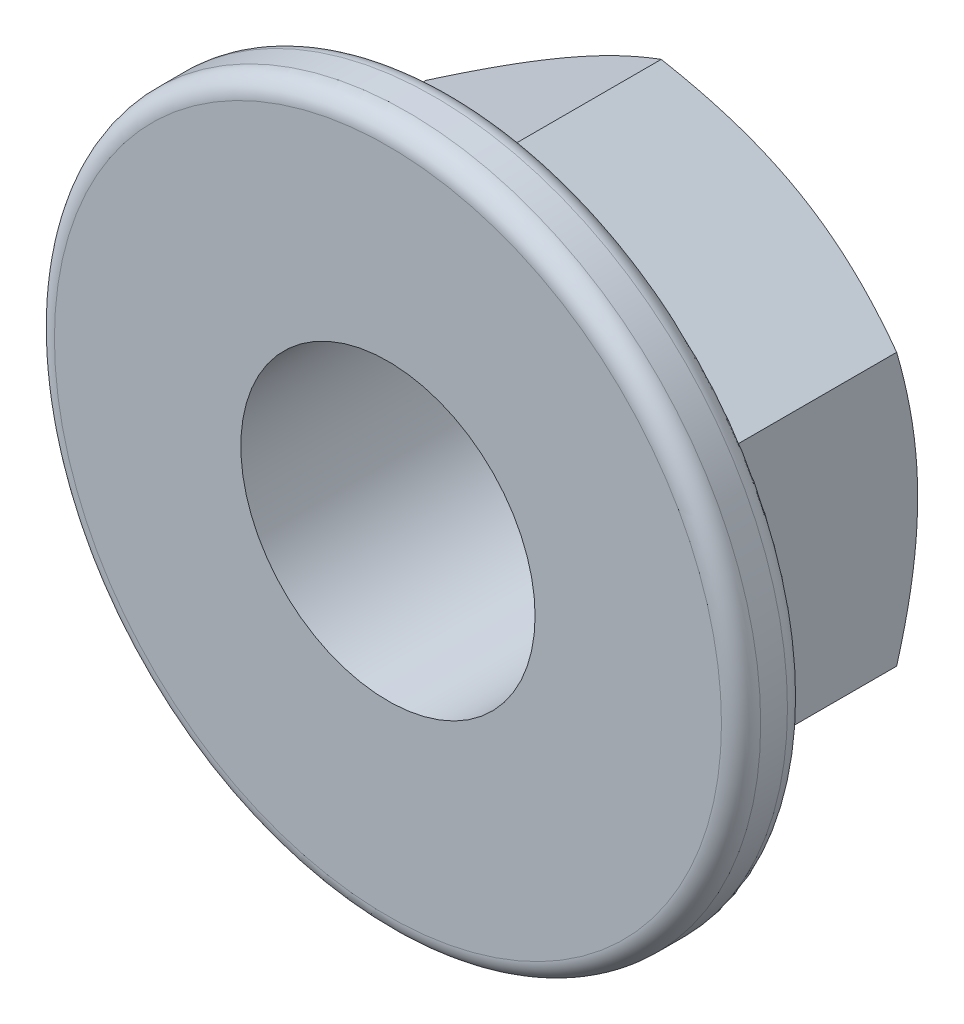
ISO-10303-21;
HEADER;
FILE_DESCRIPTION(('STEP AP214'),'2;1');
FILE_NAME('part.step','',(''),(''),'','','');
FILE_SCHEMA(('AUTOMOTIVE_DESIGN { 1 0 10303 214 1 1 1 1 }'));
ENDSEC;
DATA;
#1=APPLICATION_CONTEXT('core data for automotive mechanical design processes');
#2=APPLICATION_PROTOCOL_DEFINITION('international standard','automotive_design',2000,#1);
#3=PRODUCT_CONTEXT('',#1,'mechanical');
#4=PRODUCT('Part','Part','',(#3));
#5=PRODUCT_RELATED_PRODUCT_CATEGORY('part','',(#4));
#6=PRODUCT_DEFINITION_FORMATION('','',#4);
#7=PRODUCT_DEFINITION_CONTEXT('part definition',#1,'design');
#8=PRODUCT_DEFINITION('design','',#6,#7);
#9=PRODUCT_DEFINITION_SHAPE('','',#8);
#10=(LENGTH_UNIT() NAMED_UNIT(*) SI_UNIT(.MILLI.,.METRE.));
#11=(NAMED_UNIT(*) PLANE_ANGLE_UNIT() SI_UNIT($,.RADIAN.));
#12=(NAMED_UNIT(*) SI_UNIT($,.STERADIAN.) SOLID_ANGLE_UNIT());
#13=UNCERTAINTY_MEASURE_WITH_UNIT(LENGTH_MEASURE(1.E-05),#10,'distance_accuracy_value','');
#14=(GEOMETRIC_REPRESENTATION_CONTEXT(3) GLOBAL_UNCERTAINTY_ASSIGNED_CONTEXT((#13)) GLOBAL_UNIT_ASSIGNED_CONTEXT((#10,
#11,#12)) REPRESENTATION_CONTEXT('',''));
#15=CARTESIAN_POINT('',(0.,0.,0.));
#16=DIRECTION('',(0.,0.,1.));
#17=DIRECTION('',(1.,0.,0.));
#18=AXIS2_PLACEMENT_3D('',#15,#16,#17);
#19=CARTESIAN_POINT('',(4.,2.30940107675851,-5.));
#20=DIRECTION('',(0.499999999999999,0.866025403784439,0.));
#21=DIRECTION('',(-0.866025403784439,0.499999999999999,0.));
#22=AXIS2_PLACEMENT_3D('',#19,#20,#21);
#23=PLANE('',#22);
#24=DIRECTION('',(0.,0.,1.));
#25=VECTOR('',#24,1.);
#26=CARTESIAN_POINT('',(0.,4.61880215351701,-5.));
#27=LINE('',#26,#25);
#28=CARTESIAN_POINT('',(0.,4.61880215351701,-4.64273441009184));
#29=VERTEX_POINT('',#28);
#30=CARTESIAN_POINT('',(0.,4.61880215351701,-1.6440631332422));
#31=VERTEX_POINT('',#30);
#32=EDGE_CURVE('E467',#29,#31,#27,.T.);
#33=ORIENTED_EDGE('',*,*,#32,.T.);
#34=CARTESIAN_POINT('',(-0.000199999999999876,4.61891762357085,-1.64400928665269));
#35=CARTESIAN_POINT('',(0.120769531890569,4.54907583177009,-1.67657795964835));
#36=CARTESIAN_POINT('',(0.242185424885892,4.47897633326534,-1.70705523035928));
#37=CARTESIAN_POINT('',(0.48592837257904,4.33825127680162,-1.76310098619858));
#38=CARTESIAN_POINT('',(0.60825588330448,4.26762545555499,-1.78866681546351));
#39=CARTESIAN_POINT('',(0.853824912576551,4.12584611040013,-1.8341482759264));
#40=CARTESIAN_POINT('',(0.977067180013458,4.05469215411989,-1.8540585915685));
#41=CARTESIAN_POINT('',(1.22418358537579,3.91201943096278,-1.8874940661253));
#42=CARTESIAN_POINT('',(1.34805760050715,3.84050073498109,-1.90102042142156));
#43=CARTESIAN_POINT('',(1.59365872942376,3.69870285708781,-1.92094074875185));
#44=CARTESIAN_POINT('',(1.71537709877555,3.62842872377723,-1.92747679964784));
#45=CARTESIAN_POINT('',(1.95895426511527,3.48779938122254,-1.9336347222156));
#46=CARTESIAN_POINT('',(2.08081307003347,3.4174441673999,-1.93325618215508));
#47=CARTESIAN_POINT('',(2.32425174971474,3.27689478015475,-1.92560400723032));
#48=CARTESIAN_POINT('',(2.44583177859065,3.20670051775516,-1.91833679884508));
#49=CARTESIAN_POINT('',(2.68854759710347,3.0665684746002,-1.8972201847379));
#50=CARTESIAN_POINT('',(2.80968342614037,2.99663067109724,-1.88337137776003));
#51=CARTESIAN_POINT('',(3.02010677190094,2.87514269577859,-1.85398107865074));
#52=CARTESIAN_POINT('',(3.10954010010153,2.82350833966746,-1.8398003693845));
#53=CARTESIAN_POINT('',(3.28799787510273,2.72047569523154,-1.80837614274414));
#54=CARTESIAN_POINT('',(3.37702233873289,2.6690773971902,-1.79113275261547));
#55=CARTESIAN_POINT('',(3.55535029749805,2.5661197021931,-1.75371474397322));
#56=CARTESIAN_POINT('',(3.64465020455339,2.51456237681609,-1.73351749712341));
#57=CARTESIAN_POINT('',(3.82277777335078,2.41172037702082,-1.69059061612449));
#58=CARTESIAN_POINT('',(3.91160551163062,2.36043565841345,-1.66786140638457));
#59=CARTESIAN_POINT('',(4.0002,2.30928560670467,-1.64400928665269));
#60=B_SPLINE_CURVE_WITH_KNOTS('',3,(#34,#35,#36,#37,#38,#39,#40,#41,#42,#43,#44,#45,#46,#47,#48,
#49,#50,#51,#52,#53,#54,#55,#56,#57,#58,#59),.UNSPECIFIED.,.F.,.F.,(4,2,2,2,2,2,2,2,2,2,2,2,4),
(0.,0.430315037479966,0.860862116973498,1.29181253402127,1.72268215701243,2.14461740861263,
2.56657778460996,2.98814489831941,3.40967366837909,3.72234131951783,4.03499598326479,
4.35018512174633,4.66532150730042),.UNSPECIFIED.);
#61=CARTESIAN_POINT('',(4.,2.30940107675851,-1.6440631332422));
#62=VERTEX_POINT('',#61);
#63=EDGE_CURVE('E387',#31,#62,#60,.T.);
#64=ORIENTED_EDGE('',*,*,#63,.T.);
#65=DIRECTION('',(0.,0.,1.));
#66=VECTOR('',#65,1.);
#67=CARTESIAN_POINT('',(4.,2.30940107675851,-5.));
#68=LINE('',#67,#66);
#69=CARTESIAN_POINT('',(4.,2.30940107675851,-4.64273441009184));
#70=VERTEX_POINT('',#69);
#71=EDGE_CURVE('E482',#70,#62,#68,.T.);
#72=ORIENTED_EDGE('',*,*,#71,.F.);
#73=CARTESIAN_POINT('',(-0.0002,4.61891762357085,-4.64266774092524));
#74=CARTESIAN_POINT('',(0.175579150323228,4.51743148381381,-4.70128212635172));
#75=CARTESIAN_POINT('',(0.352875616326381,4.41506932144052,-4.75458967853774));
#76=CARTESIAN_POINT('',(0.710538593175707,4.2085725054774,-4.8476383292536));
#77=CARTESIAN_POINT('',(0.890911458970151,4.10443418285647,-4.8873465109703));
#78=CARTESIAN_POINT('',(1.24942181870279,3.89744813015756,-4.94915778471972));
#79=CARTESIAN_POINT('',(1.42750415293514,3.7946322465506,-4.97167226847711));
#80=CARTESIAN_POINT('',(1.78450671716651,3.58851671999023,-4.99854937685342));
#81=CARTESIAN_POINT('',(1.9634256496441,3.48521782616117,-5.00293425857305));
#82=CARTESIAN_POINT('',(2.29774284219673,3.29219970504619,-4.99380992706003));
#83=CARTESIAN_POINT('',(2.45319115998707,3.20245157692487,-4.98254104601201));
#84=CARTESIAN_POINT('',(2.76307505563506,3.02354002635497,-4.94682600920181));
#85=CARTESIAN_POINT('',(2.91750956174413,2.93437722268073,-4.92236765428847));
#86=CARTESIAN_POINT('',(3.22803232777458,2.75509682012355,-4.86122393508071));
#87=CARTESIAN_POINT('',(3.3840812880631,2.66500191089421,-4.82427939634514));
#88=CARTESIAN_POINT('',(3.69385183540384,2.48615580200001,-4.74042992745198));
#89=CARTESIAN_POINT('',(3.84757739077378,2.39740231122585,-4.69354469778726));
#90=CARTESIAN_POINT('',(4.0002,2.30928560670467,-4.64266774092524));
#91=B_SPLINE_CURVE_WITH_KNOTS('',3,(#73,#74,#75,#76,#77,#78,#79,#80,#81,#82,#83,#84,#85,#86,#87,
#88,#89,#90),.UNSPECIFIED.,.F.,.F.,(4,2,2,2,2,2,2,2,4),(0.,0.634047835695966,1.26961969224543,
1.88946157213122,2.50854226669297,3.04757825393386,3.58711366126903,4.13861653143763,
4.68903648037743),.UNSPECIFIED.);
#92=CARTESIAN_POINT('',(2.,3.46410161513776,-5.));
#93=VERTEX_POINT('',#92);
#94=EDGE_CURVE('E495',#93,#70,#91,.T.);
#95=ORIENTED_EDGE('',*,*,#94,.F.);
#96=EDGE_CURVE('E471',#29,#93,#91,.T.);
#97=ORIENTED_EDGE('',*,*,#96,.F.);
#98=EDGE_LOOP('',(#33,#64,#72,#95,#97));
#99=FACE_BOUND('',#98,.T.);
#100=ADVANCED_FACE('F368',(#99),#23,.T.);
#101=CARTESIAN_POINT('',(4.,-2.30940107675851,-5.));
#102=DIRECTION('',(1.,0.,0.));
#103=DIRECTION('',(0.,0.,-1.));
#104=AXIS2_PLACEMENT_3D('',#101,#102,#103);
#105=PLANE('',#104);
#106=ORIENTED_EDGE('',*,*,#71,.T.);
#107=CARTESIAN_POINT('',(4.,-6.18739775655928,-0.362202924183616));
#108=CARTESIAN_POINT('',(4.,-6.00693642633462,-0.432851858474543));
#109=CARTESIAN_POINT('',(4.,-5.82617418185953,-0.502746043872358));
#110=CARTESIAN_POINT('',(4.,-5.46388811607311,-0.640597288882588));
#111=CARTESIAN_POINT('',(4.,-5.28236420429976,-0.708554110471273));
#112=CARTESIAN_POINT('',(4.,-4.91784788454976,-0.842302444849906));
#113=CARTESIAN_POINT('',(4.,-4.73485262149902,-0.908086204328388));
#114=CARTESIAN_POINT('',(4.,-4.36781211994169,-1.03664742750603));
#115=CARTESIAN_POINT('',(4.,-4.18376691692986,-1.09942499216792));
#116=CARTESIAN_POINT('',(4.,-3.81684147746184,-1.22039744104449));
#117=CARTESIAN_POINT('',(4.,-3.63397756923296,-1.27864158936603));
#118=CARTESIAN_POINT('',(4.,-3.26681247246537,-1.39047286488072));
#119=CARTESIAN_POINT('',(4.,-3.08251121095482,-1.44405975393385));
#120=CARTESIAN_POINT('',(4.,-2.71244508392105,-1.54528850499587));
#121=CARTESIAN_POINT('',(4.,-2.52668171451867,-1.59293577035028));
#122=CARTESIAN_POINT('',(4.,-2.15343335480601,-1.68082422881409));
#123=CARTESIAN_POINT('',(4.,-1.96594860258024,-1.72106643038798));
#124=CARTESIAN_POINT('',(4.,-1.51998546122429,-1.8054972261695));
#125=CARTESIAN_POINT('',(4.,-1.26071352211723,-1.8457105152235));
#126=CARTESIAN_POINT('',(4.,-0.870072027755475,-1.88991157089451));
#127=CARTESIAN_POINT('',(4.,-0.739591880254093,-1.90195808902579));
#128=CARTESIAN_POINT('',(4.,-0.478219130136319,-1.92029733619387));
#129=CARTESIAN_POINT('',(4.,-0.347326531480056,-1.92659012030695));
#130=CARTESIAN_POINT('',(4.,-0.0848197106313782,-1.93320179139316));
#131=CARTESIAN_POINT('',(4.,0.0467951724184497,-1.93349455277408));
#132=CARTESIAN_POINT('',(4.,0.309899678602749,-1.92802986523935));
#133=CARTESIAN_POINT('',(4.,0.441389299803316,-1.92227232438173));
#134=CARTESIAN_POINT('',(4.,0.703999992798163,-1.90491747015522));
#135=CARTESIAN_POINT('',(4.,0.835121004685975,-1.89331925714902));
#136=CARTESIAN_POINT('',(4.,1.09674990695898,-1.86468256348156));
#137=CARTESIAN_POINT('',(4.,1.22725782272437,-1.8476443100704));
#138=CARTESIAN_POINT('',(4.,1.72125192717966,-1.77361964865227));
#139=CARTESIAN_POINT('',(4.,2.08227384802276,-1.69983844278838));
#140=CARTESIAN_POINT('',(4.,2.61888854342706,-1.56953988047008));
#141=CARTESIAN_POINT('',(4.,2.79706665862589,-1.52279524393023));
#142=CARTESIAN_POINT('',(4.,3.15196578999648,-1.42404112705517));
#143=CARTESIAN_POINT('',(4.,3.32868690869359,-1.37203202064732));
#144=CARTESIAN_POINT('',(4.,3.68188902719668,-1.26349259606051));
#145=CARTESIAN_POINT('',(4.,3.85836210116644,-1.20693682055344));
#146=CARTESIAN_POINT('',(4.,4.21018953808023,-1.09043446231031));
#147=CARTESIAN_POINT('',(4.,4.3855438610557,-1.03048775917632));
#148=CARTESIAN_POINT('',(4.,4.73519534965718,-0.90791235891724));
#149=CARTESIAN_POINT('',(4.,4.90949306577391,-0.845285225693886));
#150=CARTESIAN_POINT('',(4.,5.25728393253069,-0.717831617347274));
#151=CARTESIAN_POINT('',(4.,5.43077706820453,-0.65300510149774));
#152=CARTESIAN_POINT('',(4.,5.95183303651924,-0.455254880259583));
#153=CARTESIAN_POINT('',(4.,6.29837036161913,-0.319631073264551));
#154=CARTESIAN_POINT('',(4.,6.98953948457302,-0.0435020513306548));
#155=CARTESIAN_POINT('',(4.,7.33417099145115,0.0970038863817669));
#156=CARTESIAN_POINT('',(4.,8.01726708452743,0.379501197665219));
#157=CARTESIAN_POINT('',(4.,8.35575120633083,0.521445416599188));
#158=CARTESIAN_POINT('',(4.,8.86265658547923,0.736183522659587));
#159=CARTESIAN_POINT('',(4.,9.03146866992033,0.808058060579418));
#160=CARTESIAN_POINT('',(4.,9.36886331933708,0.95234126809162));
#161=CARTESIAN_POINT('',(4.,9.53744588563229,1.02474993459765));
#162=CARTESIAN_POINT('',(4.,9.70593010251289,1.0973868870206));
#163=B_SPLINE_CURVE_WITH_KNOTS('',3,(#107,#108,#109,#110,#111,#112,#113,#114,#115,#116,#117,
#118,#119,#120,#121,#122,#123,#124,#125,#126,#127,#128,#129,#130,#131,#132,#133,#134,#135,#136,
#137,#138,#139,#140,#141,#142,#143,#144,#145,#146,#147,#148,#149,#150,#151,#152,#153,#154,#155,
#156,#157,#158,#159,#160,#161,#162),.UNSPECIFIED.,.F.,.F.,(4,2,2,2,2,2,2,2,2,2,2,2,2,2,2,2,2,2,
2,2,2,2,2,2,2,2,2,4),(0.,0.581399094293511,1.16286931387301,1.7462289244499,2.32956892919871,
2.90526633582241,3.48099316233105,4.0561923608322,4.63131316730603,5.41758081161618,
5.81057932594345,6.20357407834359,6.59827966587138,6.99299125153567,7.38776365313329,
7.78251956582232,8.88613122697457,9.43873170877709,9.99129296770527,10.5471983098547,
11.1031234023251,11.658728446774,12.21434378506,13.3306752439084,14.4471726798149,
15.5482837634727,16.0987113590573,16.6491357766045),.UNSPECIFIED.);
#164=CARTESIAN_POINT('',(4.,-2.30940107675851,-1.6440631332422));
#165=VERTEX_POINT('',#164);
#166=EDGE_CURVE('E514',#62,#165,#163,.F.);
#167=ORIENTED_EDGE('',*,*,#166,.T.);
#168=DIRECTION('',(0.,0.,1.));
#169=VECTOR('',#168,1.);
#170=CARTESIAN_POINT('',(4.,-2.30940107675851,-5.));
#171=LINE('',#170,#169);
#172=CARTESIAN_POINT('',(4.,-2.30940107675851,-4.64273441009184));
#173=VERTEX_POINT('',#172);
#174=EDGE_CURVE('E487',#173,#165,#171,.T.);
#175=ORIENTED_EDGE('',*,*,#174,.F.);
#176=CARTESIAN_POINT('',(4.,-6.24956479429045,-3.02543639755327));
#177=CARTESIAN_POINT('',(4.,-6.07439776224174,-3.11059300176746));
#178=CARTESIAN_POINT('',(4.,-5.89883341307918,-3.19494609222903));
#179=CARTESIAN_POINT('',(4.,-5.54669883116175,-3.36159400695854));
#180=CARTESIAN_POINT('',(4.,-5.37012844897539,-3.44388851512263));
#181=CARTESIAN_POINT('',(4.,-5.01488365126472,-3.60637180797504));
#182=CARTESIAN_POINT('',(4.,-4.83620304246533,-3.68654709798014));
#183=CARTESIAN_POINT('',(4.,-4.47743595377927,-3.84367571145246));
#184=CARTESIAN_POINT('',(4.,-4.29734953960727,-3.92062918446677));
#185=CARTESIAN_POINT('',(4.,-3.92963704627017,-4.07288578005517));
#186=CARTESIAN_POINT('',(4.,-3.74195533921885,-4.14805527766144));
#187=CARTESIAN_POINT('',(4.,-3.36441371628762,-4.29281623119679));
#188=CARTESIAN_POINT('',(4.,-3.17455356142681,-4.36240706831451));
#189=CARTESIAN_POINT('',(4.,-2.79269293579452,-4.49421868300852));
#190=CARTESIAN_POINT('',(4.,-2.6006975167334,-4.55645395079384));
#191=CARTESIAN_POINT('',(4.,-2.21395365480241,-4.67158864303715));
#192=CARTESIAN_POINT('',(4.,-2.01920608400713,-4.72449095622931));
#193=CARTESIAN_POINT('',(4.,-1.62786659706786,-4.81818610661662));
#194=CARTESIAN_POINT('',(4.,-1.4312900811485,-4.85904209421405));
#195=CARTESIAN_POINT('',(4.,-1.03564620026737,-4.92634254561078));
#196=CARTESIAN_POINT('',(4.,-0.836579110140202,-4.95278858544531));
#197=CARTESIAN_POINT('',(4.,-0.439564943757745,-4.98881585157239));
#198=CARTESIAN_POINT('',(4.,-0.241638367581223,-4.9986174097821));
#199=CARTESIAN_POINT('',(4.,0.154344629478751,-5.00110762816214));
#200=CARTESIAN_POINT('',(4.,0.352401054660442,-4.9937956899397));
#201=CARTESIAN_POINT('',(4.,0.687171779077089,-4.96749417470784));
#202=CARTESIAN_POINT('',(4.,0.824239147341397,-4.95272797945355));
#203=CARTESIAN_POINT('',(4.,1.0973955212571,-4.91589243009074));
#204=CARTESIAN_POINT('',(4.,1.23348439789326,-4.89382213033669));
#205=CARTESIAN_POINT('',(4.,1.64007695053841,-4.81781302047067));
#206=CARTESIAN_POINT('',(4.,1.9087728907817,-4.75408791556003));
#207=CARTESIAN_POINT('',(4.,2.31083189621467,-4.6432167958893));
#208=CARTESIAN_POINT('',(4.,2.44626562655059,-4.60314998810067));
#209=CARTESIAN_POINT('',(4.,2.71581704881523,-4.51877130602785));
#210=CARTESIAN_POINT('',(4.,2.84993472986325,-4.47445939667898));
#211=CARTESIAN_POINT('',(4.,3.11689937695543,-4.38230870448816));
#212=CARTESIAN_POINT('',(4.,3.24974669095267,-4.33447092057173));
#213=CARTESIAN_POINT('',(4.,3.51433113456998,-4.23583971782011));
#214=CARTESIAN_POINT('',(4.,3.64606829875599,-4.18504639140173));
#215=CARTESIAN_POINT('',(4.,4.03552967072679,-4.03067602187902));
#216=CARTESIAN_POINT('',(4.,4.2918537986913,-3.92356878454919));
#217=CARTESIAN_POINT('',(4.,4.80158693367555,-3.70260238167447));
#218=CARTESIAN_POINT('',(4.,5.05499549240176,-3.58874219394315));
#219=CARTESIAN_POINT('',(4.,5.55966697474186,-3.35605493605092));
#220=CARTESIAN_POINT('',(4.,5.81092876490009,-3.23722541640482));
#221=CARTESIAN_POINT('',(4.,6.31167275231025,-2.99592495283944));
#222=CARTESIAN_POINT('',(4.,6.56115505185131,-2.87345422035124));
#223=CARTESIAN_POINT('',(4.,7.05921282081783,-2.62550837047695));
#224=CARTESIAN_POINT('',(4.,7.30778565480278,-2.50002797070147));
#225=CARTESIAN_POINT('',(4.,7.80383301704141,-2.24691149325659));
#226=CARTESIAN_POINT('',(4.,8.05130753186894,-2.11927538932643));
#227=CARTESIAN_POINT('',(4.,8.79227811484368,-1.73392509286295));
#228=CARTESIAN_POINT('',(4.,9.2844656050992,-1.47369630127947));
#229=CARTESIAN_POINT('',(4.,10.2065127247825,-0.980983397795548));
#230=CARTESIAN_POINT('',(4.,10.6366385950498,-0.748995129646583));
#231=CARTESIAN_POINT('',(4.,11.4956202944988,-0.282596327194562));
#232=CARTESIAN_POINT('',(4.,11.9244760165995,-0.0481855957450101));
#233=CARTESIAN_POINT('',(4.,12.779620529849,0.421519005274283));
#234=CARTESIAN_POINT('',(4.,13.2059129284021,0.656806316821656));
#235=CARTESIAN_POINT('',(4.,14.0577080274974,1.12871034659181));
#236=CARTESIAN_POINT('',(4.,14.4832107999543,1.36532693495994));
#237=CARTESIAN_POINT('',(4.,14.9084455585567,1.60242157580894));
#238=B_SPLINE_CURVE_WITH_KNOTS('',3,(#176,#177,#178,#179,#180,#181,#182,#183,#184,#185,#186,
#187,#188,#189,#190,#191,#192,#193,#194,#195,#196,#197,#198,#199,#200,#201,#202,#203,#204,#205,
#206,#207,#208,#209,#210,#211,#212,#213,#214,#215,#216,#217,#218,#219,#220,#221,#222,#223,#224,
#225,#226,#227,#228,#229,#230,#231,#232,#233,#234,#235,#236,#237),.UNSPECIFIED.,.F.,.F.,(4,2,2,
2,2,2,2,2,2,2,2,2,2,2,2,2,2,2,2,2,2,2,2,2,2,2,2,2,2,2,4),(0.,0.584315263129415,1.16871970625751,
1.75622594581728,2.34370488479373,2.95016239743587,3.55668708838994,4.16199629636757,
4.76711781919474,5.36900828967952,5.97083291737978,6.56462691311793,7.15844167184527,
7.57182368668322,7.9852592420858,8.8125310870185,9.23620216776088,9.65987674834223,
10.0834317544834,10.5069735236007,11.3402234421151,12.1735998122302,13.007391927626,
13.84113572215,14.6764689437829,15.5118123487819,17.1820143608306,18.6481042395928,
20.1143143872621,21.5750541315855,23.0356535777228),.UNSPECIFIED.);
#239=CARTESIAN_POINT('',(4.,0.,-5.));
#240=VERTEX_POINT('',#239);
#241=EDGE_CURVE('E561',#240,#173,#238,.F.);
#242=ORIENTED_EDGE('',*,*,#241,.F.);
#243=EDGE_CURVE('E566',#70,#240,#238,.F.);
#244=ORIENTED_EDGE('',*,*,#243,.F.);
#245=EDGE_LOOP('',(#106,#167,#175,#242,#244));
#246=FACE_BOUND('',#245,.T.);
#247=ADVANCED_FACE('F553',(#246),#105,.T.);
#248=CARTESIAN_POINT('',(4.,-2.30940107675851,-5.));
#249=DIRECTION('',(0.499999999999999,-0.866025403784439,0.));
#250=DIRECTION('',(0.866025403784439,0.499999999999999,0.));
#251=AXIS2_PLACEMENT_3D('',#248,#249,#250);
#252=PLANE('',#251);
#253=ORIENTED_EDGE('',*,*,#174,.T.);
#254=CARTESIAN_POINT('',(4.0002,-2.30928560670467,-1.64400928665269));
#255=CARTESIAN_POINT('',(3.87923046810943,-2.37912739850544,-1.67657795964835));
#256=CARTESIAN_POINT('',(3.75781457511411,-2.44922689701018,-1.70705523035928));
#257=CARTESIAN_POINT('',(3.51407162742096,-2.5899519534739,-1.76310098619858));
#258=CARTESIAN_POINT('',(3.39174411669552,-2.66057777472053,-1.78866681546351));
#259=CARTESIAN_POINT('',(3.14617508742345,-2.80235711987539,-1.8341482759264));
#260=CARTESIAN_POINT('',(3.02293281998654,-2.87351107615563,-1.8540585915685));
#261=CARTESIAN_POINT('',(2.77581641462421,-3.01618379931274,-1.8874940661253));
#262=CARTESIAN_POINT('',(2.65194239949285,-3.08770249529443,-1.90102042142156));
#263=CARTESIAN_POINT('',(2.40634127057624,-3.22950037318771,-1.92094074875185));
#264=CARTESIAN_POINT('',(2.28462290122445,-3.29977450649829,-1.92747679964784));
#265=CARTESIAN_POINT('',(2.04104573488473,-3.44040384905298,-1.9336347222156));
#266=CARTESIAN_POINT('',(1.91918692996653,-3.51075906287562,-1.93325618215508));
#267=CARTESIAN_POINT('',(1.67574825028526,-3.65130845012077,-1.92560400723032));
#268=CARTESIAN_POINT('',(1.55416822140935,-3.72150271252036,-1.91833679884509));
#269=CARTESIAN_POINT('',(1.31145240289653,-3.86163475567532,-1.8972201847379));
#270=CARTESIAN_POINT('',(1.19031657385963,-3.93157255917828,-1.88337137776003));
#271=CARTESIAN_POINT('',(0.979893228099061,-4.05306053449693,-1.85398107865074));
#272=CARTESIAN_POINT('',(0.890459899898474,-4.10469489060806,-1.8398003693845));
#273=CARTESIAN_POINT('',(0.712002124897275,-4.20772753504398,-1.80837614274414));
#274=CARTESIAN_POINT('',(0.622977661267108,-4.25912583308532,-1.79113275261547));
#275=CARTESIAN_POINT('',(0.444649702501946,-4.36208352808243,-1.75371474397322));
#276=CARTESIAN_POINT('',(0.355349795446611,-4.41364085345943,-1.73351749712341));
#277=CARTESIAN_POINT('',(0.177222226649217,-4.5164828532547,-1.69059061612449));
#278=CARTESIAN_POINT('',(0.0883944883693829,-4.56776757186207,-1.66786140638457));
#279=CARTESIAN_POINT('',(-0.000199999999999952,-4.61891762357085,-1.64400928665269));
#280=B_SPLINE_CURVE_WITH_KNOTS('',3,(#254,#255,#256,#257,#258,#259,#260,#261,#262,#263,#264,
#265,#266,#267,#268,#269,#270,#271,#272,#273,#274,#275,#276,#277,#278,#279),.UNSPECIFIED.,.F.,
.F.,(4,2,2,2,2,2,2,2,2,2,2,2,4),(0.,0.430315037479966,0.860862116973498,1.29181253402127,
1.72268215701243,2.14461740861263,2.56657778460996,2.98814489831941,3.40967366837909,
3.72234131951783,4.03499598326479,4.35018512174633,4.66532150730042),.UNSPECIFIED.);
#281=CARTESIAN_POINT('',(0.,-4.61880215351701,-1.6440631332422));
#282=VERTEX_POINT('',#281);
#283=EDGE_CURVE('E512',#165,#282,#280,.T.);
#284=ORIENTED_EDGE('',*,*,#283,.T.);
#285=DIRECTION('',(0.,0.,1.));
#286=VECTOR('',#285,1.);
#287=CARTESIAN_POINT('',(0.,-4.61880215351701,-5.));
#288=LINE('',#287,#286);
#289=CARTESIAN_POINT('',(0.,-4.61880215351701,-4.64273441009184));
#290=VERTEX_POINT('',#289);
#291=EDGE_CURVE('E469',#290,#282,#288,.T.);
#292=ORIENTED_EDGE('',*,*,#291,.F.);
#293=CARTESIAN_POINT('',(4.0002,-2.30928560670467,-4.64266774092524));
#294=CARTESIAN_POINT('',(3.82442084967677,-2.41077174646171,-4.70128212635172));
#295=CARTESIAN_POINT('',(3.64712438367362,-2.513133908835,-4.75458967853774));
#296=CARTESIAN_POINT('',(3.28946140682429,-2.71963072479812,-4.8476383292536));
#297=CARTESIAN_POINT('',(3.10908854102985,-2.82376904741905,-4.8873465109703));
#298=CARTESIAN_POINT('',(2.75057818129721,-3.03075510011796,-4.94915778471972));
#299=CARTESIAN_POINT('',(2.57249584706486,-3.13357098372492,-4.97167226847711));
#300=CARTESIAN_POINT('',(2.21549328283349,-3.33968651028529,-4.99854937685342));
#301=CARTESIAN_POINT('',(2.0365743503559,-3.44298540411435,-5.00293425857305));
#302=CARTESIAN_POINT('',(1.70225715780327,-3.63600352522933,-4.99380992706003));
#303=CARTESIAN_POINT('',(1.54680884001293,-3.72575165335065,-4.98254104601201));
#304=CARTESIAN_POINT('',(1.23692494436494,-3.90466320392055,-4.94682600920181));
#305=CARTESIAN_POINT('',(1.08249043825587,-3.99382600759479,-4.92236765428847));
#306=CARTESIAN_POINT('',(0.771967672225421,-4.17310641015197,-4.86122393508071));
#307=CARTESIAN_POINT('',(0.615918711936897,-4.26320131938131,-4.82427939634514));
#308=CARTESIAN_POINT('',(0.306148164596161,-4.44204742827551,-4.74042992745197));
#309=CARTESIAN_POINT('',(0.152422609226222,-4.53080091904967,-4.69354469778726));
#310=CARTESIAN_POINT('',(-0.00019999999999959,-4.61891762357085,-4.64266774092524));
#311=B_SPLINE_CURVE_WITH_KNOTS('',3,(#293,#294,#295,#296,#297,#298,#299,#300,#301,#302,#303,
#304,#305,#306,#307,#308,#309,#310),.UNSPECIFIED.,.F.,.F.,(4,2,2,2,2,2,2,2,4),(0.,
0.634047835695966,1.26961969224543,1.88946157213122,2.50854226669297,3.04757825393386,
3.58711366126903,4.13861653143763,4.68903648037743),.UNSPECIFIED.);
#312=CARTESIAN_POINT('',(2.,-3.46410161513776,-5.));
#313=VERTEX_POINT('',#312);
#314=EDGE_CURVE('E510',#313,#290,#311,.T.);
#315=ORIENTED_EDGE('',*,*,#314,.F.);
#316=EDGE_CURVE('E567',#173,#313,#311,.T.);
#317=ORIENTED_EDGE('',*,*,#316,.F.);
#318=EDGE_LOOP('',(#253,#284,#292,#315,#317));
#319=FACE_BOUND('',#318,.T.);
#320=ADVANCED_FACE('F508',(#319),#252,.T.);
#321=CARTESIAN_POINT('',(-4.,-2.30940107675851,-5.));
#322=DIRECTION('',(-0.499999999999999,-0.866025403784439,0.));
#323=DIRECTION('',(0.866025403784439,-0.499999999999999,0.));
#324=AXIS2_PLACEMENT_3D('',#321,#322,#323);
#325=PLANE('',#324);
#326=ORIENTED_EDGE('',*,*,#291,.T.);
#327=CARTESIAN_POINT('',(0.000199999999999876,-4.61891762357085,-1.64400928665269));
#328=CARTESIAN_POINT('',(-0.120769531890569,-4.54907583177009,-1.67657795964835));
#329=CARTESIAN_POINT('',(-0.242185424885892,-4.47897633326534,-1.70705523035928));
#330=CARTESIAN_POINT('',(-0.48592837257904,-4.33825127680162,-1.76310098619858));
#331=CARTESIAN_POINT('',(-0.60825588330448,-4.26762545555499,-1.78866681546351));
#332=CARTESIAN_POINT('',(-0.853824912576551,-4.12584611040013,-1.8341482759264));
#333=CARTESIAN_POINT('',(-0.977067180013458,-4.05469215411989,-1.8540585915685));
#334=CARTESIAN_POINT('',(-1.22418358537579,-3.91201943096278,-1.8874940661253));
#335=CARTESIAN_POINT('',(-1.34805760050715,-3.84050073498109,-1.90102042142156));
#336=CARTESIAN_POINT('',(-1.59365872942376,-3.69870285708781,-1.92094074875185));
#337=CARTESIAN_POINT('',(-1.71537709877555,-3.62842872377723,-1.92747679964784));
#338=CARTESIAN_POINT('',(-1.95895426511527,-3.48779938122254,-1.9336347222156));
#339=CARTESIAN_POINT('',(-2.08081307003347,-3.4174441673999,-1.93325618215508));
#340=CARTESIAN_POINT('',(-2.32425174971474,-3.27689478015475,-1.92560400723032));
#341=CARTESIAN_POINT('',(-2.44583177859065,-3.20670051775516,-1.91833679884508));
#342=CARTESIAN_POINT('',(-2.68854759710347,-3.0665684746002,-1.8972201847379));
#343=CARTESIAN_POINT('',(-2.80968342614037,-2.99663067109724,-1.88337137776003));
#344=CARTESIAN_POINT('',(-3.02010677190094,-2.87514269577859,-1.85398107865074));
#345=CARTESIAN_POINT('',(-3.10954010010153,-2.82350833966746,-1.8398003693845));
#346=CARTESIAN_POINT('',(-3.28799787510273,-2.72047569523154,-1.80837614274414));
#347=CARTESIAN_POINT('',(-3.37702233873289,-2.6690773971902,-1.79113275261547));
#348=CARTESIAN_POINT('',(-3.55535029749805,-2.5661197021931,-1.75371474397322));
#349=CARTESIAN_POINT('',(-3.64465020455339,-2.51456237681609,-1.73351749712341));
#350=CARTESIAN_POINT('',(-3.82277777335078,-2.41172037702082,-1.69059061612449));
#351=CARTESIAN_POINT('',(-3.91160551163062,-2.36043565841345,-1.66786140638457));
#352=CARTESIAN_POINT('',(-4.0002,-2.30928560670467,-1.64400928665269));
#353=B_SPLINE_CURVE_WITH_KNOTS('',3,(#327,#328,#329,#330,#331,#332,#333,#334,#335,#336,#337,
#338,#339,#340,#341,#342,#343,#344,#345,#346,#347,#348,#349,#350,#351,#352),.UNSPECIFIED.,.F.,
.F.,(4,2,2,2,2,2,2,2,2,2,2,2,4),(0.,0.430315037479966,0.860862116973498,1.29181253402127,
1.72268215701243,2.14461740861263,2.56657778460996,2.98814489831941,3.40967366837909,
3.72234131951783,4.03499598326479,4.35018512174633,4.66532150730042),.UNSPECIFIED.);
#354=CARTESIAN_POINT('',(-4.,-2.30940107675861,-1.6440631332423));
#355=VERTEX_POINT('',#354);
#356=EDGE_CURVE('E454',#282,#355,#353,.T.);
#357=ORIENTED_EDGE('',*,*,#356,.T.);
#358=DIRECTION('',(0.,0.,1.));
#359=VECTOR('',#358,1.);
#360=CARTESIAN_POINT('',(-4.,-2.30940107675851,-5.));
#361=LINE('',#360,#359);
#362=CARTESIAN_POINT('',(-4.,-2.30940107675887,-4.64273441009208));
#363=VERTEX_POINT('',#362);
#364=EDGE_CURVE('E452',#363,#355,#361,.T.);
#365=ORIENTED_EDGE('',*,*,#364,.F.);
#366=CARTESIAN_POINT('',(0.0002,-4.61891762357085,-4.64266774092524));
#367=CARTESIAN_POINT('',(-0.175579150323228,-4.51743148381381,-4.70128212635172));
#368=CARTESIAN_POINT('',(-0.352875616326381,-4.41506932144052,-4.75458967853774));
#369=CARTESIAN_POINT('',(-0.710538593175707,-4.2085725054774,-4.8476383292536));
#370=CARTESIAN_POINT('',(-0.890911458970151,-4.10443418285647,-4.8873465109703));
#371=CARTESIAN_POINT('',(-1.24942181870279,-3.89744813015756,-4.94915778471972));
#372=CARTESIAN_POINT('',(-1.42750415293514,-3.7946322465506,-4.97167226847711));
#373=CARTESIAN_POINT('',(-1.78450671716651,-3.58851671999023,-4.99854937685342));
#374=CARTESIAN_POINT('',(-1.9634256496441,-3.48521782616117,-5.00293425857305));
#375=CARTESIAN_POINT('',(-2.29774284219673,-3.29219970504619,-4.99380992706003));
#376=CARTESIAN_POINT('',(-2.45319115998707,-3.20245157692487,-4.98254104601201));
#377=CARTESIAN_POINT('',(-2.76307505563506,-3.02354002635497,-4.94682600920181));
#378=CARTESIAN_POINT('',(-2.91750956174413,-2.93437722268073,-4.92236765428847));
#379=CARTESIAN_POINT('',(-3.22803232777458,-2.75509682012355,-4.86122393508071));
#380=CARTESIAN_POINT('',(-3.3840812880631,-2.66500191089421,-4.82427939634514));
#381=CARTESIAN_POINT('',(-3.69385183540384,-2.48615580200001,-4.74042992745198));
#382=CARTESIAN_POINT('',(-3.84757739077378,-2.39740231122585,-4.69354469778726));
#383=CARTESIAN_POINT('',(-4.0002,-2.30928560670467,-4.64266774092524));
#384=B_SPLINE_CURVE_WITH_KNOTS('',3,(#366,#367,#368,#369,#370,#371,#372,#373,#374,#375,#376,
#377,#378,#379,#380,#381,#382,#383),.UNSPECIFIED.,.F.,.F.,(4,2,2,2,2,2,2,2,4),(0.,
0.634047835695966,1.26961969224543,1.88946157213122,2.50854226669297,3.04757825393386,
3.58711366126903,4.13861653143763,4.68903648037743),.UNSPECIFIED.);
#385=CARTESIAN_POINT('',(-2.,-3.46410161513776,-5.));
#386=VERTEX_POINT('',#385);
#387=EDGE_CURVE('E595',#386,#363,#384,.T.);
#388=ORIENTED_EDGE('',*,*,#387,.F.);
#389=EDGE_CURVE('E394',#290,#386,#384,.T.);
#390=ORIENTED_EDGE('',*,*,#389,.F.);
#391=EDGE_LOOP('',(#326,#357,#365,#388,#390));
#392=FACE_BOUND('',#391,.T.);
#393=ADVANCED_FACE('F504',(#392),#325,.T.);
#394=CARTESIAN_POINT('',(-4.,-2.30940107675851,-5.));
#395=DIRECTION('',(-1.,0.,0.));
#396=DIRECTION('',(0.,0.,1.));
#397=AXIS2_PLACEMENT_3D('',#394,#395,#396);
#398=PLANE('',#397);
#399=ORIENTED_EDGE('',*,*,#364,.T.);
#400=CARTESIAN_POINT('',(-4.,-6.18739775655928,-0.362202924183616));
#401=CARTESIAN_POINT('',(-4.,-6.00693642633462,-0.432851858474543));
#402=CARTESIAN_POINT('',(-4.,-5.82617418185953,-0.502746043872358));
#403=CARTESIAN_POINT('',(-4.,-5.46388811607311,-0.640597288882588));
#404=CARTESIAN_POINT('',(-4.,-5.28236420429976,-0.708554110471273));
#405=CARTESIAN_POINT('',(-4.,-4.91784788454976,-0.842302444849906));
#406=CARTESIAN_POINT('',(-4.,-4.73485262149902,-0.908086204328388));
#407=CARTESIAN_POINT('',(-4.,-4.36781211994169,-1.03664742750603));
#408=CARTESIAN_POINT('',(-4.,-4.18376691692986,-1.09942499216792));
#409=CARTESIAN_POINT('',(-4.,-3.81684147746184,-1.22039744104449));
#410=CARTESIAN_POINT('',(-4.,-3.63397756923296,-1.27864158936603));
#411=CARTESIAN_POINT('',(-4.,-3.26681247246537,-1.39047286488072));
#412=CARTESIAN_POINT('',(-4.,-3.08251121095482,-1.44405975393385));
#413=CARTESIAN_POINT('',(-4.,-2.71244508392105,-1.54528850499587));
#414=CARTESIAN_POINT('',(-4.,-2.52668171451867,-1.59293577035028));
#415=CARTESIAN_POINT('',(-4.,-2.15343335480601,-1.68082422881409));
#416=CARTESIAN_POINT('',(-4.,-1.96594860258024,-1.72106643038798));
#417=CARTESIAN_POINT('',(-4.,-1.51998546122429,-1.8054972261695));
#418=CARTESIAN_POINT('',(-4.,-1.26071352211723,-1.8457105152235));
#419=CARTESIAN_POINT('',(-4.,-0.870072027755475,-1.88991157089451));
#420=CARTESIAN_POINT('',(-4.,-0.739591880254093,-1.90195808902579));
#421=CARTESIAN_POINT('',(-4.,-0.478219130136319,-1.92029733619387));
#422=CARTESIAN_POINT('',(-4.,-0.347326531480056,-1.92659012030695));
#423=CARTESIAN_POINT('',(-4.,-0.0848197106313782,-1.93320179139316));
#424=CARTESIAN_POINT('',(-4.,0.0467951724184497,-1.93349455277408));
#425=CARTESIAN_POINT('',(-4.,0.309899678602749,-1.92802986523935));
#426=CARTESIAN_POINT('',(-4.,0.441389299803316,-1.92227232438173));
#427=CARTESIAN_POINT('',(-4.,0.703999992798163,-1.90491747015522));
#428=CARTESIAN_POINT('',(-4.,0.835121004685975,-1.89331925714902));
#429=CARTESIAN_POINT('',(-4.,1.09674990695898,-1.86468256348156));
#430=CARTESIAN_POINT('',(-4.,1.22725782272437,-1.8476443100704));
#431=CARTESIAN_POINT('',(-4.,1.72125192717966,-1.77361964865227));
#432=CARTESIAN_POINT('',(-4.,2.08227384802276,-1.69983844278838));
#433=CARTESIAN_POINT('',(-4.,2.61888854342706,-1.56953988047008));
#434=CARTESIAN_POINT('',(-4.,2.79706665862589,-1.52279524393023));
#435=CARTESIAN_POINT('',(-4.,3.15196578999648,-1.42404112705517));
#436=CARTESIAN_POINT('',(-4.,3.32868690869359,-1.37203202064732));
#437=CARTESIAN_POINT('',(-4.,3.68188902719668,-1.26349259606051));
#438=CARTESIAN_POINT('',(-4.,3.85836210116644,-1.20693682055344));
#439=CARTESIAN_POINT('',(-4.,4.21018953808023,-1.09043446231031));
#440=CARTESIAN_POINT('',(-4.,4.3855438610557,-1.03048775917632));
#441=CARTESIAN_POINT('',(-4.,4.73519534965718,-0.90791235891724));
#442=CARTESIAN_POINT('',(-4.,4.90949306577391,-0.845285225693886));
#443=CARTESIAN_POINT('',(-4.,5.25728393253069,-0.717831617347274));
#444=CARTESIAN_POINT('',(-4.,5.43077706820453,-0.65300510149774));
#445=CARTESIAN_POINT('',(-4.,5.95183303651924,-0.455254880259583));
#446=CARTESIAN_POINT('',(-4.,6.29837036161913,-0.319631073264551));
#447=CARTESIAN_POINT('',(-4.,6.98953948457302,-0.0435020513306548));
#448=CARTESIAN_POINT('',(-4.,7.33417099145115,0.0970038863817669));
#449=CARTESIAN_POINT('',(-4.,8.01726708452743,0.379501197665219));
#450=CARTESIAN_POINT('',(-4.,8.35575120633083,0.521445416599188));
#451=CARTESIAN_POINT('',(-4.,8.86265658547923,0.736183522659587));
#452=CARTESIAN_POINT('',(-4.,9.03146866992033,0.808058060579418));
#453=CARTESIAN_POINT('',(-4.,9.36886331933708,0.95234126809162));
#454=CARTESIAN_POINT('',(-4.,9.53744588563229,1.02474993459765));
#455=CARTESIAN_POINT('',(-4.,9.70593010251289,1.0973868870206));
#456=B_SPLINE_CURVE_WITH_KNOTS('',3,(#400,#401,#402,#403,#404,#405,#406,#407,#408,#409,#410,
#411,#412,#413,#414,#415,#416,#417,#418,#419,#420,#421,#422,#423,#424,#425,#426,#427,#428,#429,
#430,#431,#432,#433,#434,#435,#436,#437,#438,#439,#440,#441,#442,#443,#444,#445,#446,#447,#448,
#449,#450,#451,#452,#453,#454,#455),.UNSPECIFIED.,.F.,.F.,(4,2,2,2,2,2,2,2,2,2,2,2,2,2,2,2,2,2,
2,2,2,2,2,2,2,2,2,4),(0.,0.581399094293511,1.16286931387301,1.7462289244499,2.32956892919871,
2.90526633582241,3.48099316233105,4.0561923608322,4.63131316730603,5.41758081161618,
5.81057932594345,6.20357407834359,6.59827966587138,6.99299125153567,7.38776365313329,
7.78251956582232,8.88613122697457,9.43873170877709,9.99129296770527,10.5471983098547,
11.1031234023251,11.658728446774,12.21434378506,13.3306752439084,14.4471726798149,
15.5482837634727,16.0987113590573,16.6491357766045),.UNSPECIFIED.);
#457=CARTESIAN_POINT('',(-4.,2.30940107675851,-1.6440631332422));
#458=VERTEX_POINT('',#457);
#459=EDGE_CURVE('E445',#355,#458,#456,.T.);
#460=ORIENTED_EDGE('',*,*,#459,.T.);
#461=DIRECTION('',(0.,0.,1.));
#462=VECTOR('',#461,1.);
#463=CARTESIAN_POINT('',(-4.,2.30940107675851,-5.));
#464=LINE('',#463,#462);
#465=CARTESIAN_POINT('',(-4.,2.30940107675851,-4.64273441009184));
#466=VERTEX_POINT('',#465);
#467=EDGE_CURVE('E449',#466,#458,#464,.T.);
#468=ORIENTED_EDGE('',*,*,#467,.F.);
#469=CARTESIAN_POINT('',(-4.,-6.24956479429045,-3.02543639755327));
#470=CARTESIAN_POINT('',(-4.,-6.07439776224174,-3.11059300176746));
#471=CARTESIAN_POINT('',(-4.,-5.89883341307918,-3.19494609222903));
#472=CARTESIAN_POINT('',(-4.,-5.54669883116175,-3.36159400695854));
#473=CARTESIAN_POINT('',(-4.,-5.37012844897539,-3.44388851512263));
#474=CARTESIAN_POINT('',(-4.,-5.01488365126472,-3.60637180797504));
#475=CARTESIAN_POINT('',(-4.,-4.83620304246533,-3.68654709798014));
#476=CARTESIAN_POINT('',(-4.,-4.47743595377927,-3.84367571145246));
#477=CARTESIAN_POINT('',(-4.,-4.29734953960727,-3.92062918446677));
#478=CARTESIAN_POINT('',(-4.,-3.92963704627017,-4.07288578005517));
#479=CARTESIAN_POINT('',(-4.,-3.74195533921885,-4.14805527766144));
#480=CARTESIAN_POINT('',(-4.,-3.36441371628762,-4.29281623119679));
#481=CARTESIAN_POINT('',(-4.,-3.17455356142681,-4.36240706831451));
#482=CARTESIAN_POINT('',(-4.,-2.79269293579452,-4.49421868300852));
#483=CARTESIAN_POINT('',(-4.,-2.6006975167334,-4.55645395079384));
#484=CARTESIAN_POINT('',(-4.,-2.21395365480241,-4.67158864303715));
#485=CARTESIAN_POINT('',(-4.,-2.01920608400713,-4.72449095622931));
#486=CARTESIAN_POINT('',(-4.,-1.62786659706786,-4.81818610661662));
#487=CARTESIAN_POINT('',(-4.,-1.4312900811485,-4.85904209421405));
#488=CARTESIAN_POINT('',(-4.,-1.03564620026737,-4.92634254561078));
#489=CARTESIAN_POINT('',(-4.,-0.836579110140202,-4.95278858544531));
#490=CARTESIAN_POINT('',(-4.,-0.439564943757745,-4.98881585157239));
#491=CARTESIAN_POINT('',(-4.,-0.241638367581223,-4.9986174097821));
#492=CARTESIAN_POINT('',(-4.,0.154344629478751,-5.00110762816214));
#493=CARTESIAN_POINT('',(-4.,0.352401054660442,-4.9937956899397));
#494=CARTESIAN_POINT('',(-4.,0.687171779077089,-4.96749417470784));
#495=CARTESIAN_POINT('',(-4.,0.824239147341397,-4.95272797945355));
#496=CARTESIAN_POINT('',(-4.,1.0973955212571,-4.91589243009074));
#497=CARTESIAN_POINT('',(-4.,1.23348439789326,-4.89382213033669));
#498=CARTESIAN_POINT('',(-4.,1.64007695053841,-4.81781302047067));
#499=CARTESIAN_POINT('',(-4.,1.9087728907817,-4.75408791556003));
#500=CARTESIAN_POINT('',(-4.,2.31083189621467,-4.6432167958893));
#501=CARTESIAN_POINT('',(-4.,2.44626562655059,-4.60314998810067));
#502=CARTESIAN_POINT('',(-4.,2.71581704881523,-4.51877130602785));
#503=CARTESIAN_POINT('',(-4.,2.84993472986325,-4.47445939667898));
#504=CARTESIAN_POINT('',(-4.,3.11689937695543,-4.38230870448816));
#505=CARTESIAN_POINT('',(-4.,3.24974669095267,-4.33447092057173));
#506=CARTESIAN_POINT('',(-4.,3.51433113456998,-4.23583971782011));
#507=CARTESIAN_POINT('',(-4.,3.64606829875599,-4.18504639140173));
#508=CARTESIAN_POINT('',(-4.,4.03552967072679,-4.03067602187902));
#509=CARTESIAN_POINT('',(-4.,4.2918537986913,-3.92356878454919));
#510=CARTESIAN_POINT('',(-4.,4.80158693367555,-3.70260238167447));
#511=CARTESIAN_POINT('',(-4.,5.05499549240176,-3.58874219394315));
#512=CARTESIAN_POINT('',(-4.,5.55966697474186,-3.35605493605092));
#513=CARTESIAN_POINT('',(-4.,5.81092876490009,-3.23722541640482));
#514=CARTESIAN_POINT('',(-4.,6.31167275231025,-2.99592495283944));
#515=CARTESIAN_POINT('',(-4.,6.56115505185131,-2.87345422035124));
#516=CARTESIAN_POINT('',(-4.,7.05921282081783,-2.62550837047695));
#517=CARTESIAN_POINT('',(-4.,7.30778565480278,-2.50002797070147));
#518=CARTESIAN_POINT('',(-4.,7.80383301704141,-2.24691149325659));
#519=CARTESIAN_POINT('',(-4.,8.05130753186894,-2.11927538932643));
#520=CARTESIAN_POINT('',(-4.,8.79227811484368,-1.73392509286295));
#521=CARTESIAN_POINT('',(-4.,9.2844656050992,-1.47369630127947));
#522=CARTESIAN_POINT('',(-4.,10.2065127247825,-0.980983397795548));
#523=CARTESIAN_POINT('',(-4.,10.6366385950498,-0.748995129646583));
#524=CARTESIAN_POINT('',(-4.,11.4956202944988,-0.282596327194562));
#525=CARTESIAN_POINT('',(-4.,11.9244760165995,-0.0481855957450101));
#526=CARTESIAN_POINT('',(-4.,12.779620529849,0.421519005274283));
#527=CARTESIAN_POINT('',(-4.,13.2059129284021,0.656806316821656));
#528=CARTESIAN_POINT('',(-4.,14.0577080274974,1.12871034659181));
#529=CARTESIAN_POINT('',(-4.,14.4832107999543,1.36532693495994));
#530=CARTESIAN_POINT('',(-4.,14.9084455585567,1.60242157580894));
#531=B_SPLINE_CURVE_WITH_KNOTS('',3,(#469,#470,#471,#472,#473,#474,#475,#476,#477,#478,#479,
#480,#481,#482,#483,#484,#485,#486,#487,#488,#489,#490,#491,#492,#493,#494,#495,#496,#497,#498,
#499,#500,#501,#502,#503,#504,#505,#506,#507,#508,#509,#510,#511,#512,#513,#514,#515,#516,#517,
#518,#519,#520,#521,#522,#523,#524,#525,#526,#527,#528,#529,#530),.UNSPECIFIED.,.F.,.F.,(4,2,2,
2,2,2,2,2,2,2,2,2,2,2,2,2,2,2,2,2,2,2,2,2,2,2,2,2,2,2,4),(0.,0.584315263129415,1.16871970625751,
1.75622594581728,2.34370488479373,2.95016239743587,3.55668708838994,4.16199629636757,
4.76711781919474,5.36900828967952,5.97083291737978,6.56462691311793,7.15844167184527,
7.57182368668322,7.9852592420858,8.8125310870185,9.23620216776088,9.65987674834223,
10.0834317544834,10.5069735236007,11.3402234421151,12.1735998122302,13.007391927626,
13.84113572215,14.6764689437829,15.5118123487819,17.1820143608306,18.6481042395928,
20.1143143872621,21.5750541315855,23.0356535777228),.UNSPECIFIED.);
#532=CARTESIAN_POINT('',(-4.,0.,-5.));
#533=VERTEX_POINT('',#532);
#534=EDGE_CURVE('E590',#533,#466,#531,.T.);
#535=ORIENTED_EDGE('',*,*,#534,.F.);
#536=EDGE_CURVE('E599',#363,#533,#531,.T.);
#537=ORIENTED_EDGE('',*,*,#536,.F.);
#538=EDGE_LOOP('',(#399,#460,#468,#535,#537));
#539=FACE_BOUND('',#538,.T.);
#540=ADVANCED_FACE('F446',(#539),#398,.T.);
#541=CARTESIAN_POINT('',(-4.,2.30940107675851,-5.));
#542=DIRECTION('',(-0.499999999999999,0.866025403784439,0.));
#543=DIRECTION('',(-0.866025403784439,-0.499999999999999,0.));
#544=AXIS2_PLACEMENT_3D('',#541,#542,#543);
#545=PLANE('',#544);
#546=ORIENTED_EDGE('',*,*,#467,.T.);
#547=CARTESIAN_POINT('',(-4.0002,2.30928560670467,-1.64400928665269));
#548=CARTESIAN_POINT('',(-3.87923046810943,2.37912739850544,-1.67657795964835));
#549=CARTESIAN_POINT('',(-3.75781457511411,2.44922689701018,-1.70705523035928));
#550=CARTESIAN_POINT('',(-3.51407162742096,2.5899519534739,-1.76310098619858));
#551=CARTESIAN_POINT('',(-3.39174411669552,2.66057777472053,-1.78866681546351));
#552=CARTESIAN_POINT('',(-3.14617508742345,2.80235711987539,-1.8341482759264));
#553=CARTESIAN_POINT('',(-3.02293281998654,2.87351107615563,-1.8540585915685));
#554=CARTESIAN_POINT('',(-2.77581641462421,3.01618379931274,-1.8874940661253));
#555=CARTESIAN_POINT('',(-2.65194239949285,3.08770249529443,-1.90102042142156));
#556=CARTESIAN_POINT('',(-2.40634127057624,3.22950037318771,-1.92094074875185));
#557=CARTESIAN_POINT('',(-2.28462290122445,3.29977450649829,-1.92747679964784));
#558=CARTESIAN_POINT('',(-2.04104573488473,3.44040384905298,-1.9336347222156));
#559=CARTESIAN_POINT('',(-1.91918692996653,3.51075906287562,-1.93325618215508));
#560=CARTESIAN_POINT('',(-1.67574825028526,3.65130845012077,-1.92560400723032));
#561=CARTESIAN_POINT('',(-1.55416822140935,3.72150271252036,-1.91833679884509));
#562=CARTESIAN_POINT('',(-1.31145240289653,3.86163475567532,-1.8972201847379));
#563=CARTESIAN_POINT('',(-1.19031657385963,3.93157255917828,-1.88337137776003));
#564=CARTESIAN_POINT('',(-0.979893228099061,4.05306053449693,-1.85398107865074));
#565=CARTESIAN_POINT('',(-0.890459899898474,4.10469489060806,-1.8398003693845));
#566=CARTESIAN_POINT('',(-0.712002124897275,4.20772753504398,-1.80837614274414));
#567=CARTESIAN_POINT('',(-0.622977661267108,4.25912583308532,-1.79113275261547));
#568=CARTESIAN_POINT('',(-0.444649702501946,4.36208352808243,-1.75371474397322));
#569=CARTESIAN_POINT('',(-0.355349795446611,4.41364085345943,-1.73351749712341));
#570=CARTESIAN_POINT('',(-0.177222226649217,4.5164828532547,-1.69059061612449));
#571=CARTESIAN_POINT('',(-0.0883944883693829,4.56776757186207,-1.66786140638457));
#572=CARTESIAN_POINT('',(0.000199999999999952,4.61891762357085,-1.64400928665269));
#573=B_SPLINE_CURVE_WITH_KNOTS('',3,(#547,#548,#549,#550,#551,#552,#553,#554,#555,#556,#557,
#558,#559,#560,#561,#562,#563,#564,#565,#566,#567,#568,#569,#570,#571,#572),.UNSPECIFIED.,.F.,
.F.,(4,2,2,2,2,2,2,2,2,2,2,2,4),(0.,0.430315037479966,0.860862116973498,1.29181253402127,
1.72268215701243,2.14461740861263,2.56657778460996,2.98814489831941,3.40967366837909,
3.72234131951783,4.03499598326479,4.35018512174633,4.66532150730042),.UNSPECIFIED.);
#574=EDGE_CURVE('E11',#458,#31,#573,.T.);
#575=ORIENTED_EDGE('',*,*,#574,.T.);
#576=ORIENTED_EDGE('',*,*,#32,.F.);
#577=CARTESIAN_POINT('',(-4.0002,2.30928560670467,-4.64266774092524));
#578=CARTESIAN_POINT('',(-3.82442084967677,2.41077174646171,-4.70128212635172));
#579=CARTESIAN_POINT('',(-3.64712438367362,2.513133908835,-4.75458967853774));
#580=CARTESIAN_POINT('',(-3.28946140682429,2.71963072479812,-4.8476383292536));
#581=CARTESIAN_POINT('',(-3.10908854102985,2.82376904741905,-4.8873465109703));
#582=CARTESIAN_POINT('',(-2.75057818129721,3.03075510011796,-4.94915778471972));
#583=CARTESIAN_POINT('',(-2.57249584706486,3.13357098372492,-4.97167226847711));
#584=CARTESIAN_POINT('',(-2.21549328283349,3.33968651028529,-4.99854937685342));
#585=CARTESIAN_POINT('',(-2.0365743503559,3.44298540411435,-5.00293425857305));
#586=CARTESIAN_POINT('',(-1.70225715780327,3.63600352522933,-4.99380992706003));
#587=CARTESIAN_POINT('',(-1.54680884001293,3.72575165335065,-4.98254104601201));
#588=CARTESIAN_POINT('',(-1.23692494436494,3.90466320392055,-4.94682600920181));
#589=CARTESIAN_POINT('',(-1.08249043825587,3.99382600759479,-4.92236765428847));
#590=CARTESIAN_POINT('',(-0.771967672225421,4.17310641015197,-4.86122393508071));
#591=CARTESIAN_POINT('',(-0.615918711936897,4.26320131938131,-4.82427939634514));
#592=CARTESIAN_POINT('',(-0.306148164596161,4.44204742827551,-4.74042992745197));
#593=CARTESIAN_POINT('',(-0.152422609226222,4.53080091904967,-4.69354469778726));
#594=CARTESIAN_POINT('',(0.00019999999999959,4.61891762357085,-4.64266774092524));
#595=B_SPLINE_CURVE_WITH_KNOTS('',3,(#577,#578,#579,#580,#581,#582,#583,#584,#585,#586,#587,
#588,#589,#590,#591,#592,#593,#594),.UNSPECIFIED.,.F.,.F.,(4,2,2,2,2,2,2,2,4),(0.,
0.634047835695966,1.26961969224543,1.88946157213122,2.50854226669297,3.04757825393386,
3.58711366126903,4.13861653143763,4.68903648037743),.UNSPECIFIED.);
#596=CARTESIAN_POINT('',(-2.,3.46410161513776,-5.));
#597=VERTEX_POINT('',#596);
#598=EDGE_CURVE('E582',#597,#29,#595,.T.);
#599=ORIENTED_EDGE('',*,*,#598,.F.);
#600=EDGE_CURVE('E466',#466,#597,#595,.T.);
#601=ORIENTED_EDGE('',*,*,#600,.F.);
#602=EDGE_LOOP('',(#546,#575,#576,#599,#601));
#603=FACE_BOUND('',#602,.T.);
#604=ADVANCED_FACE('F463',(#603),#545,.T.);
#605=CARTESIAN_POINT('',(-4.,6.92820323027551,0.));
#606=DIRECTION('',(0.,0.,-1.));
#607=DIRECTION('',(-1.,0.,0.));
#608=AXIS2_PLACEMENT_3D('',#605,#606,#607);
#609=PLANE('',#608);
#610=CARTESIAN_POINT('',(0.,0.,0.));
#611=DIRECTION('',(0.,0.,1.));
#612=DIRECTION('',(1.,0.,0.));
#613=AXIS2_PLACEMENT_3D('',#610,#611,#612);
#614=CIRCLE('',#613,2.5);
#615=CARTESIAN_POINT('',(2.5,0.,0.));
#616=VERTEX_POINT('',#615);
#617=EDGE_CURVE('E606',#616,#616,#614,.T.);
#618=ORIENTED_EDGE('',*,*,#617,.F.);
#619=EDGE_LOOP('',(#618));
#620=FACE_BOUND('',#619,.T.);
#621=CARTESIAN_POINT('',(0.,0.,0.));
#622=DIRECTION('',(0.,0.,1.));
#623=DIRECTION('',(1.,0.,0.));
#624=AXIS2_PLACEMENT_3D('',#621,#622,#623);
#625=CIRCLE('',#624,5.66666666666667);
#626=CARTESIAN_POINT('',(5.66666666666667,0.,0.));
#627=VERTEX_POINT('',#626);
#628=EDGE_CURVE('E694',#627,#627,#625,.T.);
#629=ORIENTED_EDGE('',*,*,#628,.T.);
#630=EDGE_LOOP('',(#629));
#631=FACE_BOUND('',#630,.T.);
#632=ADVANCED_FACE('F576',(#620,#631),#609,.F.);
#633=CARTESIAN_POINT('',(0.,0.,0.));
#634=DIRECTION('',(0.,0.,1.));
#635=DIRECTION('',(1.,0.,0.));
#636=AXIS2_PLACEMENT_3D('',#633,#634,#635);
#637=CONICAL_SURFACE('',#636,12.6602540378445,1.0471975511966);
#638=ORIENTED_EDGE('',*,*,#534,.T.);
#639=ORIENTED_EDGE('',*,*,#600,.T.);
#640=CARTESIAN_POINT('',(0.,0.,-5.));
#641=DIRECTION('',(0.,0.,-1.));
#642=DIRECTION('',(-1.,0.,0.));
#643=AXIS2_PLACEMENT_3D('',#640,#641,#642);
#644=CIRCLE('',#643,4.);
#645=EDGE_CURVE('E601',#533,#597,#644,.T.);
#646=ORIENTED_EDGE('',*,*,#645,.F.);
#647=EDGE_LOOP('',(#638,#639,#646));
#648=FACE_BOUND('',#647,.T.);
#649=ADVANCED_FACE('F572',(#648),#637,.T.);
#650=ORIENTED_EDGE('',*,*,#96,.T.);
#651=CARTESIAN_POINT('',(0.,0.,-5.));
#652=DIRECTION('',(0.,0.,-1.));
#653=DIRECTION('',(-1.,0.,0.));
#654=AXIS2_PLACEMENT_3D('',#651,#652,#653);
#655=CIRCLE('',#654,4.);
#656=EDGE_CURVE('E475',#93,#597,#655,.F.);
#657=ORIENTED_EDGE('',*,*,#656,.T.);
#658=ORIENTED_EDGE('',*,*,#598,.T.);
#659=EDGE_LOOP('',(#650,#657,#658));
#660=FACE_BOUND('',#659,.T.);
#661=ADVANCED_FACE('F575',(#660),#637,.T.);
#662=ORIENTED_EDGE('',*,*,#94,.T.);
#663=ORIENTED_EDGE('',*,*,#243,.T.);
#664=EDGE_CURVE('E481',#240,#93,#655,.F.);
#665=ORIENTED_EDGE('',*,*,#664,.T.);
#666=EDGE_LOOP('',(#662,#663,#665));
#667=FACE_BOUND('',#666,.T.);
#668=ADVANCED_FACE('F621',(#667),#637,.T.);
#669=ORIENTED_EDGE('',*,*,#241,.T.);
#670=ORIENTED_EDGE('',*,*,#316,.T.);
#671=EDGE_CURVE('E479',#313,#240,#655,.F.);
#672=ORIENTED_EDGE('',*,*,#671,.T.);
#673=EDGE_LOOP('',(#669,#670,#672));
#674=FACE_BOUND('',#673,.T.);
#675=ADVANCED_FACE('F616',(#674),#637,.T.);
#676=ORIENTED_EDGE('',*,*,#314,.T.);
#677=ORIENTED_EDGE('',*,*,#389,.T.);
#678=EDGE_CURVE('E474',#386,#313,#655,.F.);
#679=ORIENTED_EDGE('',*,*,#678,.T.);
#680=EDGE_LOOP('',(#676,#677,#679));
#681=FACE_BOUND('',#680,.T.);
#682=ADVANCED_FACE('F619',(#681),#637,.T.);
#683=ORIENTED_EDGE('',*,*,#387,.T.);
#684=ORIENTED_EDGE('',*,*,#536,.T.);
#685=EDGE_CURVE('E380',#533,#386,#655,.F.);
#686=ORIENTED_EDGE('',*,*,#685,.T.);
#687=EDGE_LOOP('',(#683,#684,#686));
#688=FACE_BOUND('',#687,.T.);
#689=ADVANCED_FACE('F578',(#688),#637,.T.);
#690=CARTESIAN_POINT('',(-4.,6.92820323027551,-5.));
#691=DIRECTION('',(0.,0.,-1.));
#692=DIRECTION('',(-1.,0.,0.));
#693=AXIS2_PLACEMENT_3D('',#690,#691,#692);
#694=PLANE('',#693);
#695=CARTESIAN_POINT('',(0.,0.,-5.));
#696=DIRECTION('',(0.,0.,1.));
#697=DIRECTION('',(1.,0.,0.));
#698=AXIS2_PLACEMENT_3D('',#695,#696,#697);
#699=CIRCLE('',#698,2.5);
#700=CARTESIAN_POINT('',(2.5,0.,-5.));
#701=VERTEX_POINT('',#700);
#702=EDGE_CURVE('E603',#701,#701,#699,.T.);
#703=ORIENTED_EDGE('',*,*,#702,.T.);
#704=EDGE_LOOP('',(#703));
#705=FACE_BOUND('',#704,.T.);
#706=ORIENTED_EDGE('',*,*,#685,.F.);
#707=ORIENTED_EDGE('',*,*,#645,.T.);
#708=ORIENTED_EDGE('',*,*,#656,.F.);
#709=ORIENTED_EDGE('',*,*,#664,.F.);
#710=ORIENTED_EDGE('',*,*,#671,.F.);
#711=ORIENTED_EDGE('',*,*,#678,.F.);
#712=EDGE_LOOP('',(#706,#707,#708,#709,#710,#711));
#713=FACE_BOUND('',#712,.T.);
#714=ADVANCED_FACE('F557',(#705,#713),#694,.T.);
#715=CARTESIAN_POINT('',(0.,0.,-5.));
#716=DIRECTION('',(0.,0.,1.));
#717=DIRECTION('',(1.,0.,0.));
#718=AXIS2_PLACEMENT_3D('',#715,#716,#717);
#719=CYLINDRICAL_SURFACE('',#718,2.5);
#720=ORIENTED_EDGE('',*,*,#702,.F.);
#721=EDGE_LOOP('',(#720));
#722=FACE_BOUND('',#721,.T.);
#723=ORIENTED_EDGE('',*,*,#617,.T.);
#724=EDGE_LOOP('',(#723));
#725=FACE_BOUND('',#724,.T.);
#726=ADVANCED_FACE('F537',(#722,#725),#719,.F.);
#727=CARTESIAN_POINT('',(0.,0.,-1.93261531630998));
#728=DIRECTION('',(0.,0.,1.));
#729=DIRECTION('',(1.,0.,0.));
#730=AXIS2_PLACEMENT_3D('',#727,#728,#729);
#731=CONICAL_SURFACE('',#730,4.,1.13446401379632);
#732=ORIENTED_EDGE('',*,*,#63,.F.);
#733=ORIENTED_EDGE('',*,*,#574,.F.);
#734=ORIENTED_EDGE('',*,*,#459,.F.);
#735=ORIENTED_EDGE('',*,*,#356,.F.);
#736=ORIENTED_EDGE('',*,*,#283,.F.);
#737=ORIENTED_EDGE('',*,*,#166,.F.);
#738=EDGE_LOOP('',(#732,#733,#734,#735,#736,#737));
#739=FACE_BOUND('',#738,.T.);
#740=CARTESIAN_POINT('',(0.,0.,-1.08974584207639));
#741=DIRECTION('',(0.,0.,1.));
#742=DIRECTION('',(1.,0.,0.));
#743=AXIS2_PLACEMENT_3D('',#740,#741,#742);
#744=CIRCLE('',#743,5.80753942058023);
#745=CARTESIAN_POINT('',(5.80753942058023,0.,-1.08974584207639));
#746=VERTEX_POINT('',#745);
#747=EDGE_CURVE('E455',#746,#746,#744,.T.);
#748=ORIENTED_EDGE('',*,*,#747,.F.);
#749=EDGE_LOOP('',(#748));
#750=FACE_BOUND('',#749,.T.);
#751=ADVANCED_FACE('F457',(#739,#750),#731,.T.);
#752=CARTESIAN_POINT('',(0.,0.,-0.787643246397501));
#753=DIRECTION('',(0.,0.,1.));
#754=DIRECTION('',(1.,0.,0.));
#755=AXIS2_PLACEMENT_3D('',#752,#753,#754);
#756=TOROIDAL_SURFACE('',#755,5.66666666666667,0.333333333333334);
#757=CARTESIAN_POINT('',(0.,0.,-0.787643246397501));
#758=DIRECTION('',(0.,0.,1.));
#759=DIRECTION('',(1.,0.,0.));
#760=AXIS2_PLACEMENT_3D('',#757,#758,#759);
#761=CIRCLE('',#760,6.);
#762=CARTESIAN_POINT('',(6.,0.,-0.787643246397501));
#763=VERTEX_POINT('',#762);
#764=EDGE_CURVE('E698',#763,#763,#761,.T.);
#765=ORIENTED_EDGE('',*,*,#764,.F.);
#766=EDGE_LOOP('',(#765));
#767=FACE_BOUND('',#766,.T.);
#768=ORIENTED_EDGE('',*,*,#747,.T.);
#769=EDGE_LOOP('',(#768));
#770=FACE_BOUND('',#769,.T.);
#771=ADVANCED_FACE('F536',(#767,#770),#756,.T.);
#772=CARTESIAN_POINT('',(0.,0.,0.));
#773=DIRECTION('',(0.,0.,1.));
#774=DIRECTION('',(1.,0.,0.));
#775=AXIS2_PLACEMENT_3D('',#772,#773,#774);
#776=CYLINDRICAL_SURFACE('',#775,6.);
#777=CARTESIAN_POINT('',(0.,0.,-0.333333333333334));
#778=DIRECTION('',(0.,0.,1.));
#779=DIRECTION('',(1.,0.,0.));
#780=AXIS2_PLACEMENT_3D('',#777,#778,#779);
#781=CIRCLE('',#780,6.);
#782=CARTESIAN_POINT('',(6.,0.,-0.333333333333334));
#783=VERTEX_POINT('',#782);
#784=EDGE_CURVE('E697',#783,#783,#781,.T.);
#785=ORIENTED_EDGE('',*,*,#784,.F.);
#786=EDGE_LOOP('',(#785));
#787=FACE_BOUND('',#786,.T.);
#788=ORIENTED_EDGE('',*,*,#764,.T.);
#789=EDGE_LOOP('',(#788));
#790=FACE_BOUND('',#789,.T.);
#791=ADVANCED_FACE('F674',(#787,#790),#776,.T.);
#792=CARTESIAN_POINT('',(0.,0.,-0.333333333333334));
#793=DIRECTION('',(0.,0.,1.));
#794=DIRECTION('',(1.,0.,0.));
#795=AXIS2_PLACEMENT_3D('',#792,#793,#794);
#796=TOROIDAL_SURFACE('',#795,5.66666666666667,0.333333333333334);
#797=ORIENTED_EDGE('',*,*,#628,.F.);
#798=EDGE_LOOP('',(#797));
#799=FACE_BOUND('',#798,.T.);
#800=ORIENTED_EDGE('',*,*,#784,.T.);
#801=EDGE_LOOP('',(#800));
#802=FACE_BOUND('',#801,.T.);
#803=ADVANCED_FACE('F681',(#799,#802),#796,.T.);
#804=CLOSED_SHELL('',(#100,#247,#320,#393,#540,#604,#632,#649,#661,#668,#675,#682,#689,#714,
#726,#751,#771,#791,#803));
#805=MANIFOLD_SOLID_BREP('B2',#804);
#806=ADVANCED_BREP_SHAPE_REPRESENTATION('',(#18,#805),#14);
#807=SHAPE_DEFINITION_REPRESENTATION(#9,#806);
ENDSEC;
END-ISO-10303-21;
